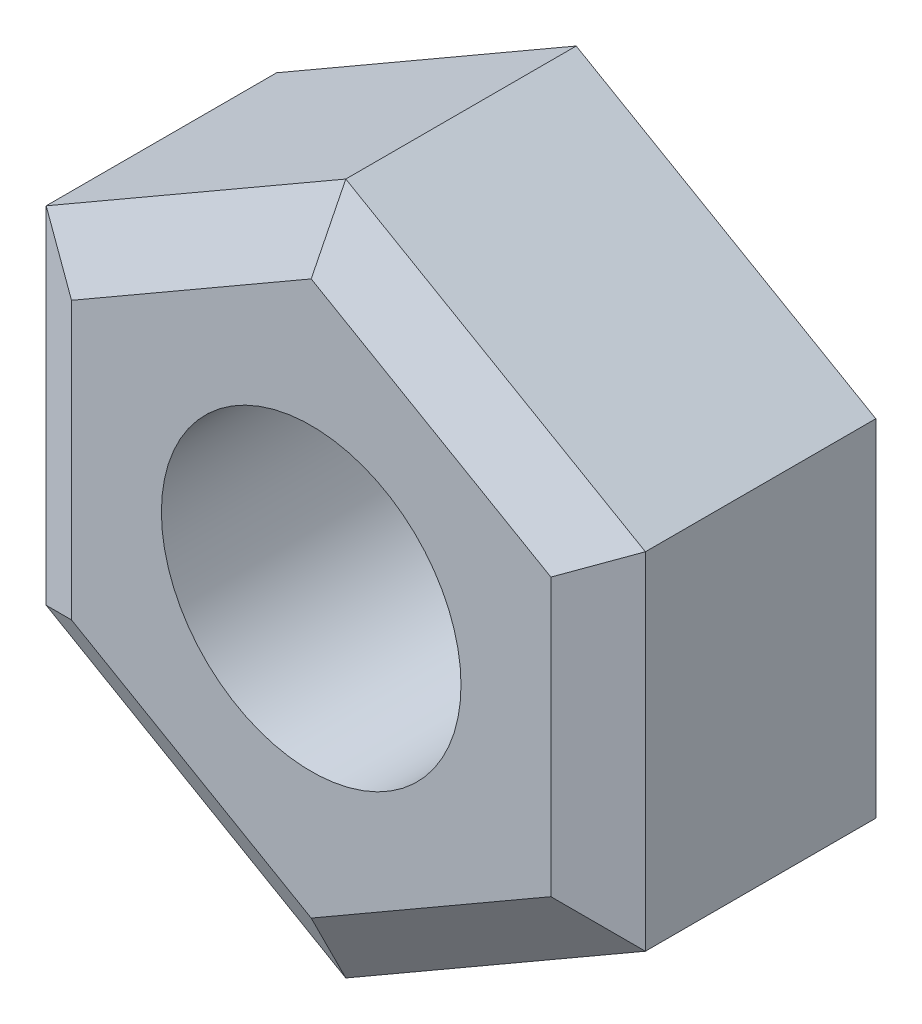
ISO-10303-21;
HEADER;
FILE_DESCRIPTION(('STEP AP214'),'2;1');
FILE_NAME('part.step','',(''),(''),'','','');
FILE_SCHEMA(('AUTOMOTIVE_DESIGN { 1 0 10303 214 1 1 1 1 }'));
ENDSEC;
DATA;
#1=APPLICATION_CONTEXT('core data for automotive mechanical design processes');
#2=APPLICATION_PROTOCOL_DEFINITION('international standard','automotive_design',2000,#1);
#3=PRODUCT_CONTEXT('',#1,'mechanical');
#4=PRODUCT('Part','Part','',(#3));
#5=PRODUCT_RELATED_PRODUCT_CATEGORY('part','',(#4));
#6=PRODUCT_DEFINITION_FORMATION('','',#4);
#7=PRODUCT_DEFINITION_CONTEXT('part definition',#1,'design');
#8=PRODUCT_DEFINITION('design','',#6,#7);
#9=PRODUCT_DEFINITION_SHAPE('','',#8);
#10=(LENGTH_UNIT() NAMED_UNIT(*) SI_UNIT(.MILLI.,.METRE.));
#11=(NAMED_UNIT(*) PLANE_ANGLE_UNIT() SI_UNIT($,.RADIAN.));
#12=(NAMED_UNIT(*) SI_UNIT($,.STERADIAN.) SOLID_ANGLE_UNIT());
#13=UNCERTAINTY_MEASURE_WITH_UNIT(LENGTH_MEASURE(1.E-05),#10,'distance_accuracy_value','');
#14=(GEOMETRIC_REPRESENTATION_CONTEXT(3) GLOBAL_UNCERTAINTY_ASSIGNED_CONTEXT((#13)) GLOBAL_UNIT_ASSIGNED_CONTEXT((#10,
#11,#12)) REPRESENTATION_CONTEXT('',''));
#15=CARTESIAN_POINT('',(0.,0.,0.));
#16=DIRECTION('',(0.,0.,1.));
#17=DIRECTION('',(1.,0.,0.));
#18=AXIS2_PLACEMENT_3D('',#15,#16,#17);
#19=CARTESIAN_POINT('',(0.,-5.77350269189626,5.));
#20=DIRECTION('',(-0.5,0.866025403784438,0.));
#21=DIRECTION('',(-0.866025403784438,-0.5,0.));
#22=AXIS2_PLACEMENT_3D('',#19,#20,#21);
#23=PLANE('',#22);
#24=DIRECTION('',(0.,0.,-1.));
#25=VECTOR('',#24,1.);
#26=CARTESIAN_POINT('',(0.,-5.77350269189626,5.));
#27=LINE('',#26,#25);
#28=CARTESIAN_POINT('',(0.,-5.77350269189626,4.42264973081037));
#29=VERTEX_POINT('',#28);
#30=CARTESIAN_POINT('',(0.,-5.77350269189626,0.577350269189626));
#31=VERTEX_POINT('',#30);
#32=EDGE_CURVE('E294',#29,#31,#27,.T.);
#33=ORIENTED_EDGE('',*,*,#32,.T.);
#34=DIRECTION('',(0.866025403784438,0.5,0.));
#35=VECTOR('',#34,1.);
#36=CARTESIAN_POINT('',(0.,-5.77350269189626,0.577350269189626));
#37=LINE('',#36,#35);
#38=CARTESIAN_POINT('',(5.,-2.88675134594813,0.577350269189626));
#39=VERTEX_POINT('',#38);
#40=EDGE_CURVE('E196',#31,#39,#37,.T.);
#41=ORIENTED_EDGE('',*,*,#40,.T.);
#42=DIRECTION('',(0.,0.,-1.));
#43=VECTOR('',#42,1.);
#44=CARTESIAN_POINT('',(5.,-2.88675134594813,5.));
#45=LINE('',#44,#43);
#46=CARTESIAN_POINT('',(5.,-2.88675134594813,4.42264973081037));
#47=VERTEX_POINT('',#46);
#48=EDGE_CURVE('E166',#47,#39,#45,.T.);
#49=ORIENTED_EDGE('',*,*,#48,.F.);
#50=DIRECTION('',(-0.866025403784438,-0.5,0.));
#51=VECTOR('',#50,1.);
#52=CARTESIAN_POINT('',(0.,-5.77350269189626,4.42264973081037));
#53=LINE('',#52,#51);
#54=EDGE_CURVE('E177',#47,#29,#53,.T.);
#55=ORIENTED_EDGE('',*,*,#54,.T.);
#56=EDGE_LOOP('',(#33,#41,#49,#55));
#57=FACE_BOUND('',#56,.T.);
#58=ADVANCED_FACE('F51',(#57),#23,.F.);
#59=CARTESIAN_POINT('',(5.,-2.88675134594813,5.));
#60=DIRECTION('',(-1.,0.,0.));
#61=DIRECTION('',(0.,-1.,0.));
#62=AXIS2_PLACEMENT_3D('',#59,#60,#61);
#63=PLANE('',#62);
#64=ORIENTED_EDGE('',*,*,#48,.T.);
#65=DIRECTION('',(0.,1.,0.));
#66=VECTOR('',#65,1.);
#67=CARTESIAN_POINT('',(5.,-2.88675134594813,0.577350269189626));
#68=LINE('',#67,#66);
#69=CARTESIAN_POINT('',(5.,2.88675134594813,0.577350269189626));
#70=VERTEX_POINT('',#69);
#71=EDGE_CURVE('E11',#39,#70,#68,.T.);
#72=ORIENTED_EDGE('',*,*,#71,.T.);
#73=DIRECTION('',(0.,0.,-1.));
#74=VECTOR('',#73,1.);
#75=CARTESIAN_POINT('',(5.,2.88675134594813,5.));
#76=LINE('',#75,#74);
#77=CARTESIAN_POINT('',(5.,2.88675134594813,4.42264973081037));
#78=VERTEX_POINT('',#77);
#79=EDGE_CURVE('E318',#78,#70,#76,.T.);
#80=ORIENTED_EDGE('',*,*,#79,.F.);
#81=DIRECTION('',(0.,-1.,0.));
#82=VECTOR('',#81,1.);
#83=CARTESIAN_POINT('',(5.,-2.88675134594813,4.42264973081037));
#84=LINE('',#83,#82);
#85=EDGE_CURVE('E151',#78,#47,#84,.T.);
#86=ORIENTED_EDGE('',*,*,#85,.T.);
#87=EDGE_LOOP('',(#64,#72,#80,#86));
#88=FACE_BOUND('',#87,.T.);
#89=ADVANCED_FACE('F336',(#88),#63,.F.);
#90=CARTESIAN_POINT('',(5.,2.88675134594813,5.));
#91=DIRECTION('',(-0.5,-0.866025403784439,0.));
#92=DIRECTION('',(0.866025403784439,-0.5,0.));
#93=AXIS2_PLACEMENT_3D('',#90,#91,#92);
#94=PLANE('',#93);
#95=ORIENTED_EDGE('',*,*,#79,.T.);
#96=DIRECTION('',(-0.866025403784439,0.5,0.));
#97=VECTOR('',#96,1.);
#98=CARTESIAN_POINT('',(5.,2.88675134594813,0.577350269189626));
#99=LINE('',#98,#97);
#100=CARTESIAN_POINT('',(0.,5.77350269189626,0.577350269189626));
#101=VERTEX_POINT('',#100);
#102=EDGE_CURVE('E62',#70,#101,#99,.T.);
#103=ORIENTED_EDGE('',*,*,#102,.T.);
#104=DIRECTION('',(0.,0.,-1.));
#105=VECTOR('',#104,1.);
#106=CARTESIAN_POINT('',(0.,5.77350269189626,5.));
#107=LINE('',#106,#105);
#108=CARTESIAN_POINT('',(0.,5.77350269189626,4.42264973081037));
#109=VERTEX_POINT('',#108);
#110=EDGE_CURVE('E315',#109,#101,#107,.T.);
#111=ORIENTED_EDGE('',*,*,#110,.F.);
#112=DIRECTION('',(0.866025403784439,-0.5,0.));
#113=VECTOR('',#112,1.);
#114=CARTESIAN_POINT('',(5.,2.88675134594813,4.42264973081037));
#115=LINE('',#114,#113);
#116=EDGE_CURVE('E194',#109,#78,#115,.T.);
#117=ORIENTED_EDGE('',*,*,#116,.T.);
#118=EDGE_LOOP('',(#95,#103,#111,#117));
#119=FACE_BOUND('',#118,.T.);
#120=ADVANCED_FACE('F337',(#119),#94,.F.);
#121=CARTESIAN_POINT('',(0.,5.77350269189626,5.));
#122=DIRECTION('',(0.5,-0.866025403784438,0.));
#123=DIRECTION('',(0.866025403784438,0.5,0.));
#124=AXIS2_PLACEMENT_3D('',#121,#122,#123);
#125=PLANE('',#124);
#126=ORIENTED_EDGE('',*,*,#110,.T.);
#127=DIRECTION('',(-0.866025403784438,-0.5,0.));
#128=VECTOR('',#127,1.);
#129=CARTESIAN_POINT('',(0.,5.77350269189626,0.577350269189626));
#130=LINE('',#129,#128);
#131=CARTESIAN_POINT('',(-5.,2.88675134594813,0.577350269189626));
#132=VERTEX_POINT('',#131);
#133=EDGE_CURVE('E243',#101,#132,#130,.T.);
#134=ORIENTED_EDGE('',*,*,#133,.T.);
#135=DIRECTION('',(0.,0.,-1.));
#136=VECTOR('',#135,1.);
#137=CARTESIAN_POINT('',(-5.,2.88675134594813,5.));
#138=LINE('',#137,#136);
#139=CARTESIAN_POINT('',(-5.,2.88675134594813,4.42264973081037));
#140=VERTEX_POINT('',#139);
#141=EDGE_CURVE('E306',#140,#132,#138,.T.);
#142=ORIENTED_EDGE('',*,*,#141,.F.);
#143=DIRECTION('',(0.866025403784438,0.5,0.));
#144=VECTOR('',#143,1.);
#145=CARTESIAN_POINT('',(0.,5.77350269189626,4.42264973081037));
#146=LINE('',#145,#144);
#147=EDGE_CURVE('E191',#140,#109,#146,.T.);
#148=ORIENTED_EDGE('',*,*,#147,.T.);
#149=EDGE_LOOP('',(#126,#134,#142,#148));
#150=FACE_BOUND('',#149,.T.);
#151=ADVANCED_FACE('F405',(#150),#125,.F.);
#152=CARTESIAN_POINT('',(-5.,2.88675134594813,5.));
#153=DIRECTION('',(1.,0.,0.));
#154=DIRECTION('',(0.,1.,0.));
#155=AXIS2_PLACEMENT_3D('',#152,#153,#154);
#156=PLANE('',#155);
#157=ORIENTED_EDGE('',*,*,#141,.T.);
#158=DIRECTION('',(0.,-1.,0.));
#159=VECTOR('',#158,1.);
#160=CARTESIAN_POINT('',(-5.,2.88675134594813,0.577350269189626));
#161=LINE('',#160,#159);
#162=CARTESIAN_POINT('',(-5.,-2.88675134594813,0.577350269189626));
#163=VERTEX_POINT('',#162);
#164=EDGE_CURVE('E240',#132,#163,#161,.T.);
#165=ORIENTED_EDGE('',*,*,#164,.T.);
#166=DIRECTION('',(0.,0.,-1.));
#167=VECTOR('',#166,1.);
#168=CARTESIAN_POINT('',(-5.,-2.88675134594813,5.));
#169=LINE('',#168,#167);
#170=CARTESIAN_POINT('',(-5.,-2.88675134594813,4.42264973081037));
#171=VERTEX_POINT('',#170);
#172=EDGE_CURVE('E297',#171,#163,#169,.T.);
#173=ORIENTED_EDGE('',*,*,#172,.F.);
#174=DIRECTION('',(0.,1.,0.));
#175=VECTOR('',#174,1.);
#176=CARTESIAN_POINT('',(-5.,2.88675134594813,4.42264973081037));
#177=LINE('',#176,#175);
#178=EDGE_CURVE('E188',#171,#140,#177,.T.);
#179=ORIENTED_EDGE('',*,*,#178,.T.);
#180=EDGE_LOOP('',(#157,#165,#173,#179));
#181=FACE_BOUND('',#180,.T.);
#182=ADVANCED_FACE('F407',(#181),#156,.F.);
#183=CARTESIAN_POINT('',(-5.,-2.88675134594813,5.));
#184=DIRECTION('',(0.5,0.866025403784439,0.));
#185=DIRECTION('',(-0.866025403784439,0.5,0.));
#186=AXIS2_PLACEMENT_3D('',#183,#184,#185);
#187=PLANE('',#186);
#188=ORIENTED_EDGE('',*,*,#172,.T.);
#189=DIRECTION('',(0.866025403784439,-0.5,0.));
#190=VECTOR('',#189,1.);
#191=CARTESIAN_POINT('',(-5.,-2.88675134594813,0.577350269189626));
#192=LINE('',#191,#190);
#193=EDGE_CURVE('E237',#163,#31,#192,.T.);
#194=ORIENTED_EDGE('',*,*,#193,.T.);
#195=ORIENTED_EDGE('',*,*,#32,.F.);
#196=DIRECTION('',(-0.866025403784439,0.5,0.));
#197=VECTOR('',#196,1.);
#198=CARTESIAN_POINT('',(-5.,-2.88675134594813,4.42264973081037));
#199=LINE('',#198,#197);
#200=EDGE_CURVE('E185',#29,#171,#199,.T.);
#201=ORIENTED_EDGE('',*,*,#200,.T.);
#202=EDGE_LOOP('',(#188,#194,#195,#201));
#203=FACE_BOUND('',#202,.T.);
#204=ADVANCED_FACE('F293',(#203),#187,.F.);
#205=CARTESIAN_POINT('',(0.,0.,5.));
#206=DIRECTION('',(0.,0.,1.));
#207=DIRECTION('',(1.,0.,0.));
#208=AXIS2_PLACEMENT_3D('',#205,#206,#207);
#209=PLANE('',#208);
#210=DIRECTION('',(0.866025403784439,0.5,0.));
#211=VECTOR('',#210,1.);
#212=CARTESIAN_POINT('',(4.5,-2.02072594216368,5.));
#213=LINE('',#212,#211);
#214=CARTESIAN_POINT('',(0.,-4.618802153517,5.));
#215=VERTEX_POINT('',#214);
#216=CARTESIAN_POINT('',(3.99999999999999,-2.3094010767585,5.));
#217=VERTEX_POINT('',#216);
#218=EDGE_CURVE('E171',#215,#217,#213,.T.);
#219=ORIENTED_EDGE('',*,*,#218,.T.);
#220=DIRECTION('',(0.,1.,0.));
#221=VECTOR('',#220,1.);
#222=CARTESIAN_POINT('',(3.99999999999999,2.88675134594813,5.));
#223=LINE('',#222,#221);
#224=CARTESIAN_POINT('',(3.99999999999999,2.3094010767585,5.));
#225=VERTEX_POINT('',#224);
#226=EDGE_CURVE('E149',#217,#225,#223,.T.);
#227=ORIENTED_EDGE('',*,*,#226,.T.);
#228=DIRECTION('',(-0.866025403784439,0.5,0.));
#229=VECTOR('',#228,1.);
#230=CARTESIAN_POINT('',(-0.500000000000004,4.90747728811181,5.));
#231=LINE('',#230,#229);
#232=CARTESIAN_POINT('',(0.,4.618802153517,5.));
#233=VERTEX_POINT('',#232);
#234=EDGE_CURVE('E158',#225,#233,#231,.T.);
#235=ORIENTED_EDGE('',*,*,#234,.T.);
#236=DIRECTION('',(-0.866025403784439,-0.5,0.));
#237=VECTOR('',#236,1.);
#238=CARTESIAN_POINT('',(-4.5,2.02072594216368,5.));
#239=LINE('',#238,#237);
#240=CARTESIAN_POINT('',(-3.99999999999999,2.3094010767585,5.));
#241=VERTEX_POINT('',#240);
#242=EDGE_CURVE('E165',#233,#241,#239,.T.);
#243=ORIENTED_EDGE('',*,*,#242,.T.);
#244=DIRECTION('',(0.,-1.,0.));
#245=VECTOR('',#244,1.);
#246=CARTESIAN_POINT('',(-3.99999999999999,-2.88675134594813,5.));
#247=LINE('',#246,#245);
#248=CARTESIAN_POINT('',(-3.99999999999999,-2.3094010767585,5.));
#249=VERTEX_POINT('',#248);
#250=EDGE_CURVE('E325',#241,#249,#247,.T.);
#251=ORIENTED_EDGE('',*,*,#250,.T.);
#252=DIRECTION('',(0.866025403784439,-0.5,0.));
#253=VECTOR('',#252,1.);
#254=CARTESIAN_POINT('',(0.500000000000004,-4.90747728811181,5.));
#255=LINE('',#254,#253);
#256=EDGE_CURVE('E179',#249,#215,#255,.T.);
#257=ORIENTED_EDGE('',*,*,#256,.T.);
#258=EDGE_LOOP('',(#219,#227,#235,#243,#251,#257));
#259=FACE_BOUND('',#258,.T.);
#260=CARTESIAN_POINT('',(0.,0.,5.));
#261=DIRECTION('',(0.,0.,1.));
#262=DIRECTION('',(1.,0.,0.));
#263=AXIS2_PLACEMENT_3D('',#260,#261,#262);
#264=CIRCLE('',#263,2.5);
#265=CARTESIAN_POINT('',(2.5,0.,5.));
#266=VERTEX_POINT('',#265);
#267=EDGE_CURVE('E214',#266,#266,#264,.T.);
#268=ORIENTED_EDGE('',*,*,#267,.F.);
#269=EDGE_LOOP('',(#268));
#270=FACE_BOUND('',#269,.T.);
#271=ADVANCED_FACE('F168',(#259,#270),#209,.T.);
#272=CARTESIAN_POINT('',(0.,0.,0.));
#273=DIRECTION('',(0.,0.,1.));
#274=DIRECTION('',(1.,0.,0.));
#275=AXIS2_PLACEMENT_3D('',#272,#273,#274);
#276=PLANE('',#275);
#277=DIRECTION('',(0.,-1.,0.));
#278=VECTOR('',#277,1.);
#279=CARTESIAN_POINT('',(3.99999999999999,0.,0.));
#280=LINE('',#279,#278);
#281=CARTESIAN_POINT('',(3.99999999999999,2.3094010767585,0.));
#282=VERTEX_POINT('',#281);
#283=CARTESIAN_POINT('',(4.,-2.3094010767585,0.));
#284=VERTEX_POINT('',#283);
#285=EDGE_CURVE('E218',#282,#284,#280,.T.);
#286=ORIENTED_EDGE('',*,*,#285,.T.);
#287=DIRECTION('',(-0.866025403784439,-0.5,0.));
#288=VECTOR('',#287,1.);
#289=CARTESIAN_POINT('',(2.,-3.46410161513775,0.));
#290=LINE('',#289,#288);
#291=CARTESIAN_POINT('',(0.,-4.618802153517,0.));
#292=VERTEX_POINT('',#291);
#293=EDGE_CURVE('E233',#284,#292,#290,.T.);
#294=ORIENTED_EDGE('',*,*,#293,.T.);
#295=DIRECTION('',(-0.866025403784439,0.5,0.));
#296=VECTOR('',#295,1.);
#297=CARTESIAN_POINT('',(-2.,-3.46410161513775,0.));
#298=LINE('',#297,#296);
#299=CARTESIAN_POINT('',(-4.,-2.3094010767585,0.));
#300=VERTEX_POINT('',#299);
#301=EDGE_CURVE('E230',#292,#300,#298,.T.);
#302=ORIENTED_EDGE('',*,*,#301,.T.);
#303=DIRECTION('',(0.,1.,0.));
#304=VECTOR('',#303,1.);
#305=CARTESIAN_POINT('',(-4.,0.,0.));
#306=LINE('',#305,#304);
#307=CARTESIAN_POINT('',(-4.,2.3094010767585,0.));
#308=VERTEX_POINT('',#307);
#309=EDGE_CURVE('E227',#300,#308,#306,.T.);
#310=ORIENTED_EDGE('',*,*,#309,.T.);
#311=DIRECTION('',(0.866025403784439,0.5,0.));
#312=VECTOR('',#311,1.);
#313=CARTESIAN_POINT('',(-2.,3.46410161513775,0.));
#314=LINE('',#313,#312);
#315=CARTESIAN_POINT('',(0.,4.618802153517,0.));
#316=VERTEX_POINT('',#315);
#317=EDGE_CURVE('E224',#308,#316,#314,.T.);
#318=ORIENTED_EDGE('',*,*,#317,.T.);
#319=DIRECTION('',(0.866025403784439,-0.5,0.));
#320=VECTOR('',#319,1.);
#321=CARTESIAN_POINT('',(2.,3.46410161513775,0.));
#322=LINE('',#321,#320);
#323=EDGE_CURVE('E221',#316,#282,#322,.T.);
#324=ORIENTED_EDGE('',*,*,#323,.T.);
#325=EDGE_LOOP('',(#286,#294,#302,#310,#318,#324));
#326=FACE_BOUND('',#325,.T.);
#327=CARTESIAN_POINT('',(0.,0.,0.));
#328=DIRECTION('',(0.,0.,1.));
#329=DIRECTION('',(1.,0.,0.));
#330=AXIS2_PLACEMENT_3D('',#327,#328,#329);
#331=CIRCLE('',#330,2.5);
#332=CARTESIAN_POINT('',(2.5,0.,0.));
#333=VERTEX_POINT('',#332);
#334=EDGE_CURVE('E302',#333,#333,#331,.T.);
#335=ORIENTED_EDGE('',*,*,#334,.T.);
#336=EDGE_LOOP('',(#335));
#337=FACE_BOUND('',#336,.T.);
#338=ADVANCED_FACE('F279',(#326,#337),#276,.F.);
#339=CARTESIAN_POINT('',(0.,0.,5.));
#340=DIRECTION('',(0.,0.,1.));
#341=DIRECTION('',(1.,0.,0.));
#342=AXIS2_PLACEMENT_3D('',#339,#340,#341);
#343=CYLINDRICAL_SURFACE('',#342,2.5);
#344=ORIENTED_EDGE('',*,*,#334,.F.);
#345=EDGE_LOOP('',(#344));
#346=FACE_BOUND('',#345,.T.);
#347=ORIENTED_EDGE('',*,*,#267,.T.);
#348=EDGE_LOOP('',(#347));
#349=FACE_BOUND('',#348,.T.);
#350=ADVANCED_FACE('F392',(#346,#349),#343,.F.);
#351=CARTESIAN_POINT('',(-3.99999999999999,0.,5.));
#352=DIRECTION('',(-0.499999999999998,0.,0.86602540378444));
#353=DIRECTION('',(0.,1.,0.));
#354=AXIS2_PLACEMENT_3D('',#351,#352,#353);
#355=PLANE('',#354);
#356=DIRECTION('',(0.774596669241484,-0.447213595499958,0.447213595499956));
#357=VECTOR('',#356,1.);
#358=CARTESIAN_POINT('',(-3.19999999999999,1.8475208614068,5.4618802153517));
#359=LINE('',#358,#357);
#360=EDGE_CURVE('E206',#140,#241,#359,.T.);
#361=ORIENTED_EDGE('',*,*,#360,.F.);
#362=ORIENTED_EDGE('',*,*,#178,.F.);
#363=DIRECTION('',(0.774596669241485,0.447213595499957,0.447213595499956));
#364=VECTOR('',#363,1.);
#365=CARTESIAN_POINT('',(-3.19999999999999,-1.8475208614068,5.4618802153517));
#366=LINE('',#365,#364);
#367=EDGE_CURVE('E210',#249,#171,#366,.F.);
#368=ORIENTED_EDGE('',*,*,#367,.F.);
#369=ORIENTED_EDGE('',*,*,#250,.F.);
#370=EDGE_LOOP('',(#361,#362,#368,#369));
#371=FACE_BOUND('',#370,.T.);
#372=ADVANCED_FACE('F388',(#371),#355,.T.);
#373=CARTESIAN_POINT('',(-2.,-3.46410161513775,5.));
#374=DIRECTION('',(-0.249999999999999,-0.433012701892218,0.866025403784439));
#375=DIRECTION('',(-0.866025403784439,0.5,0.));
#376=AXIS2_PLACEMENT_3D('',#373,#374,#375);
#377=PLANE('',#376);
#378=ORIENTED_EDGE('',*,*,#367,.T.);
#379=ORIENTED_EDGE('',*,*,#200,.F.);
#380=DIRECTION('',(0.,0.894427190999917,0.447213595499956));
#381=VECTOR('',#380,1.);
#382=CARTESIAN_POINT('',(0.,-3.69504172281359,5.4618802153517));
#383=LINE('',#382,#381);
#384=EDGE_CURVE('E202',#215,#29,#383,.F.);
#385=ORIENTED_EDGE('',*,*,#384,.F.);
#386=ORIENTED_EDGE('',*,*,#256,.F.);
#387=EDGE_LOOP('',(#378,#379,#385,#386));
#388=FACE_BOUND('',#387,.T.);
#389=ADVANCED_FACE('F333',(#388),#377,.T.);
#390=CARTESIAN_POINT('',(-2.,3.46410161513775,5.));
#391=DIRECTION('',(-0.249999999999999,0.433012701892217,0.86602540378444));
#392=DIRECTION('',(0.866025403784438,0.5,0.));
#393=AXIS2_PLACEMENT_3D('',#390,#391,#392);
#394=PLANE('',#393);
#395=ORIENTED_EDGE('',*,*,#360,.T.);
#396=ORIENTED_EDGE('',*,*,#242,.F.);
#397=DIRECTION('',(0.,-0.894427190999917,0.447213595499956));
#398=VECTOR('',#397,1.);
#399=CARTESIAN_POINT('',(0.,3.69504172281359,5.4618802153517));
#400=LINE('',#399,#398);
#401=EDGE_CURVE('E161',#109,#233,#400,.T.);
#402=ORIENTED_EDGE('',*,*,#401,.F.);
#403=ORIENTED_EDGE('',*,*,#147,.F.);
#404=EDGE_LOOP('',(#395,#396,#402,#403));
#405=FACE_BOUND('',#404,.T.);
#406=ADVANCED_FACE('F377',(#405),#394,.T.);
#407=CARTESIAN_POINT('',(2.,-3.46410161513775,5.));
#408=DIRECTION('',(0.249999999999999,-0.433012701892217,0.86602540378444));
#409=DIRECTION('',(-0.866025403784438,-0.5,0.));
#410=AXIS2_PLACEMENT_3D('',#407,#408,#409);
#411=PLANE('',#410);
#412=ORIENTED_EDGE('',*,*,#384,.T.);
#413=ORIENTED_EDGE('',*,*,#54,.F.);
#414=DIRECTION('',(-0.774596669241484,0.447213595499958,0.447213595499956));
#415=VECTOR('',#414,1.);
#416=CARTESIAN_POINT('',(3.19999999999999,-1.8475208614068,5.4618802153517));
#417=LINE('',#416,#415);
#418=EDGE_CURVE('E155',#217,#47,#417,.F.);
#419=ORIENTED_EDGE('',*,*,#418,.F.);
#420=ORIENTED_EDGE('',*,*,#218,.F.);
#421=EDGE_LOOP('',(#412,#413,#419,#420));
#422=FACE_BOUND('',#421,.T.);
#423=ADVANCED_FACE('F335',(#422),#411,.T.);
#424=CARTESIAN_POINT('',(2.,3.46410161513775,5.));
#425=DIRECTION('',(0.249999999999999,0.433012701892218,0.86602540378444));
#426=DIRECTION('',(0.866025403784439,-0.5,0.));
#427=AXIS2_PLACEMENT_3D('',#424,#425,#426);
#428=PLANE('',#427);
#429=ORIENTED_EDGE('',*,*,#401,.T.);
#430=ORIENTED_EDGE('',*,*,#234,.F.);
#431=DIRECTION('',(0.774596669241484,0.447213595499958,-0.447213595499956));
#432=VECTOR('',#431,1.);
#433=CARTESIAN_POINT('',(3.19999999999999,1.8475208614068,5.4618802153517));
#434=LINE('',#433,#432);
#435=EDGE_CURVE('E145',#78,#225,#434,.F.);
#436=ORIENTED_EDGE('',*,*,#435,.F.);
#437=ORIENTED_EDGE('',*,*,#116,.F.);
#438=EDGE_LOOP('',(#429,#430,#436,#437));
#439=FACE_BOUND('',#438,.T.);
#440=ADVANCED_FACE('F159',(#439),#428,.T.);
#441=CARTESIAN_POINT('',(3.99999999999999,0.,5.));
#442=DIRECTION('',(0.499999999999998,0.,0.86602540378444));
#443=DIRECTION('',(0.,-1.,0.));
#444=AXIS2_PLACEMENT_3D('',#441,#442,#443);
#445=PLANE('',#444);
#446=ORIENTED_EDGE('',*,*,#418,.T.);
#447=ORIENTED_EDGE('',*,*,#85,.F.);
#448=ORIENTED_EDGE('',*,*,#435,.T.);
#449=ORIENTED_EDGE('',*,*,#226,.F.);
#450=EDGE_LOOP('',(#446,#447,#448,#449));
#451=FACE_BOUND('',#450,.T.);
#452=ADVANCED_FACE('F147',(#451),#445,.T.);
#453=CARTESIAN_POINT('',(0.,5.77350269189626,0.577350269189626));
#454=DIRECTION('',(0.25,-0.433012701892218,0.866025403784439));
#455=DIRECTION('',(-0.866025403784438,-0.5,0.));
#456=AXIS2_PLACEMENT_3D('',#453,#454,#455);
#457=PLANE('',#456);
#458=DIRECTION('',(0.,0.894427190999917,0.447213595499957));
#459=VECTOR('',#458,1.);
#460=CARTESIAN_POINT('',(0.,3.46410161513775,-0.577350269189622));
#461=LINE('',#460,#459);
#462=EDGE_CURVE('E261',#316,#101,#461,.T.);
#463=ORIENTED_EDGE('',*,*,#462,.F.);
#464=ORIENTED_EDGE('',*,*,#317,.F.);
#465=DIRECTION('',(-0.774596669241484,0.447213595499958,0.447213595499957));
#466=VECTOR('',#465,1.);
#467=CARTESIAN_POINT('',(-3.,1.73205080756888,-0.577350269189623));
#468=LINE('',#467,#466);
#469=EDGE_CURVE('E56',#132,#308,#468,.F.);
#470=ORIENTED_EDGE('',*,*,#469,.F.);
#471=ORIENTED_EDGE('',*,*,#133,.F.);
#472=EDGE_LOOP('',(#463,#464,#470,#471));
#473=FACE_BOUND('',#472,.T.);
#474=ADVANCED_FACE('F54',(#473),#457,.F.);
#475=CARTESIAN_POINT('',(-5.,2.88675134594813,0.577350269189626));
#476=DIRECTION('',(0.499999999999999,0.,0.866025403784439));
#477=DIRECTION('',(0.,-1.,0.));
#478=AXIS2_PLACEMENT_3D('',#475,#476,#477);
#479=PLANE('',#478);
#480=ORIENTED_EDGE('',*,*,#469,.T.);
#481=ORIENTED_EDGE('',*,*,#309,.F.);
#482=DIRECTION('',(-0.774596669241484,-0.447213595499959,0.447213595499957));
#483=VECTOR('',#482,1.);
#484=CARTESIAN_POINT('',(-3.,-1.73205080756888,-0.577350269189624));
#485=LINE('',#484,#483);
#486=EDGE_CURVE('E258',#163,#300,#485,.F.);
#487=ORIENTED_EDGE('',*,*,#486,.F.);
#488=ORIENTED_EDGE('',*,*,#164,.F.);
#489=EDGE_LOOP('',(#480,#481,#487,#488));
#490=FACE_BOUND('',#489,.T.);
#491=ADVANCED_FACE('F273',(#490),#479,.F.);
#492=CARTESIAN_POINT('',(5.,2.88675134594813,0.577350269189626));
#493=DIRECTION('',(-0.249999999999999,-0.433012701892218,0.866025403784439));
#494=DIRECTION('',(-0.866025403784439,0.5,0.));
#495=AXIS2_PLACEMENT_3D('',#492,#493,#494);
#496=PLANE('',#495);
#497=ORIENTED_EDGE('',*,*,#462,.T.);
#498=ORIENTED_EDGE('',*,*,#102,.F.);
#499=DIRECTION('',(0.774596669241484,0.447213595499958,0.447213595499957));
#500=VECTOR('',#499,1.);
#501=CARTESIAN_POINT('',(3.,1.73205080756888,-0.577350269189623));
#502=LINE('',#501,#500);
#503=EDGE_CURVE('E254',#282,#70,#502,.T.);
#504=ORIENTED_EDGE('',*,*,#503,.F.);
#505=ORIENTED_EDGE('',*,*,#323,.F.);
#506=EDGE_LOOP('',(#497,#498,#504,#505));
#507=FACE_BOUND('',#506,.T.);
#508=ADVANCED_FACE('F338',(#507),#496,.F.);
#509=CARTESIAN_POINT('',(-5.,-2.88675134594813,0.577350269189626));
#510=DIRECTION('',(0.249999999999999,0.433012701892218,0.866025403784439));
#511=DIRECTION('',(0.866025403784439,-0.5,0.));
#512=AXIS2_PLACEMENT_3D('',#509,#510,#511);
#513=PLANE('',#512);
#514=ORIENTED_EDGE('',*,*,#486,.T.);
#515=ORIENTED_EDGE('',*,*,#301,.F.);
#516=DIRECTION('',(0.,-0.894427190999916,0.447213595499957));
#517=VECTOR('',#516,1.);
#518=CARTESIAN_POINT('',(0.,-3.46410161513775,-0.577350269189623));
#519=LINE('',#518,#517);
#520=EDGE_CURVE('E251',#31,#292,#519,.F.);
#521=ORIENTED_EDGE('',*,*,#520,.F.);
#522=ORIENTED_EDGE('',*,*,#193,.F.);
#523=EDGE_LOOP('',(#514,#515,#521,#522));
#524=FACE_BOUND('',#523,.T.);
#525=ADVANCED_FACE('F286',(#524),#513,.F.);
#526=CARTESIAN_POINT('',(5.,-2.88675134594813,0.577350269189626));
#527=DIRECTION('',(-0.499999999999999,0.,0.866025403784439));
#528=DIRECTION('',(0.,1.,0.));
#529=AXIS2_PLACEMENT_3D('',#526,#527,#528);
#530=PLANE('',#529);
#531=ORIENTED_EDGE('',*,*,#503,.T.);
#532=ORIENTED_EDGE('',*,*,#71,.F.);
#533=DIRECTION('',(-0.774596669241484,0.447213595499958,-0.447213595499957));
#534=VECTOR('',#533,1.);
#535=CARTESIAN_POINT('',(5.,-2.88675134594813,0.577350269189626));
#536=LINE('',#535,#534);
#537=EDGE_CURVE('E248',#284,#39,#536,.F.);
#538=ORIENTED_EDGE('',*,*,#537,.F.);
#539=ORIENTED_EDGE('',*,*,#285,.F.);
#540=EDGE_LOOP('',(#531,#532,#538,#539));
#541=FACE_BOUND('',#540,.T.);
#542=ADVANCED_FACE('F341',(#541),#530,.F.);
#543=CARTESIAN_POINT('',(0.,-5.77350269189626,0.577350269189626));
#544=DIRECTION('',(-0.25,0.433012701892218,0.866025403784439));
#545=DIRECTION('',(0.866025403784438,0.5,0.));
#546=AXIS2_PLACEMENT_3D('',#543,#544,#545);
#547=PLANE('',#546);
#548=ORIENTED_EDGE('',*,*,#520,.T.);
#549=ORIENTED_EDGE('',*,*,#293,.F.);
#550=ORIENTED_EDGE('',*,*,#537,.T.);
#551=ORIENTED_EDGE('',*,*,#40,.F.);
#552=EDGE_LOOP('',(#548,#549,#550,#551));
#553=FACE_BOUND('',#552,.T.);
#554=ADVANCED_FACE('F344',(#553),#547,.F.);
#555=CLOSED_SHELL('',(#58,#89,#120,#151,#182,#204,#271,#338,#350,#372,#389,#406,#423,#440,#452,
#474,#491,#508,#525,#542,#554));
#556=MANIFOLD_SOLID_BREP('B2',#555);
#557=ADVANCED_BREP_SHAPE_REPRESENTATION('',(#18,#556),#14);
#558=SHAPE_DEFINITION_REPRESENTATION(#9,#557);
ENDSEC;
END-ISO-10303-21;
